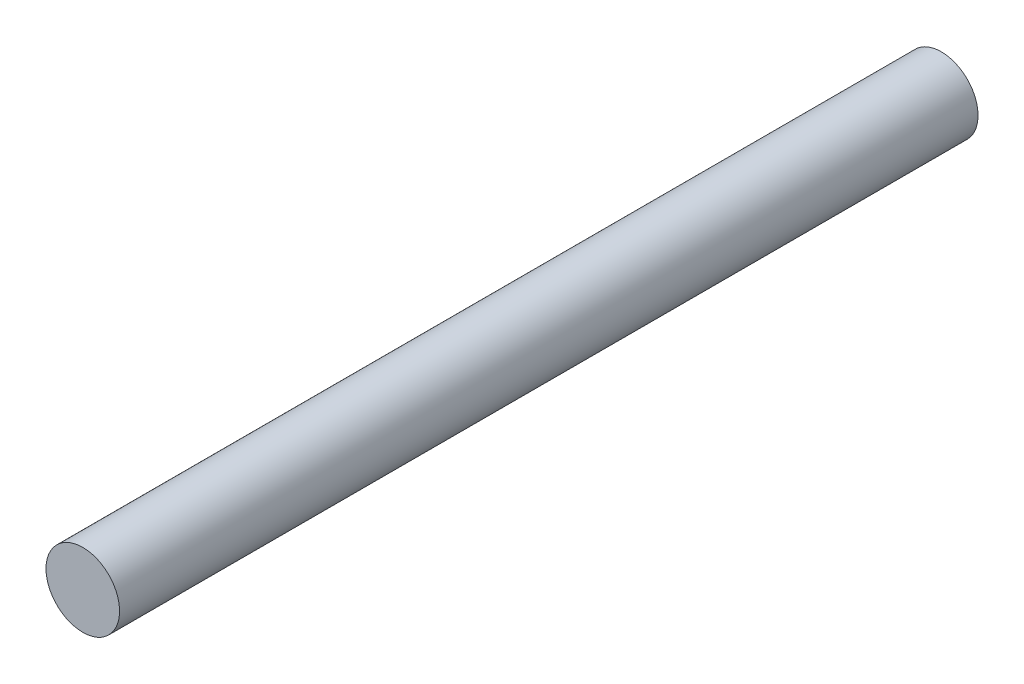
from build123d import *

# Parameters (mm, degrees)
SKETCH1_R           = 1.5
BOSS_EXTRUDE1_DEPTH = 17.5


with BuildPart() as part:
    # Sketch1 → Boss-Extrude1 (new, symmetric)
    with BuildSketch(Plane.XY):
        with Locations(Location((0, 0, 0), (0, 0, 180))):
            Circle(SKETCH1_R)
    extrude(amount=BOSS_EXTRUDE1_DEPTH, both=True)


solid = part.part
